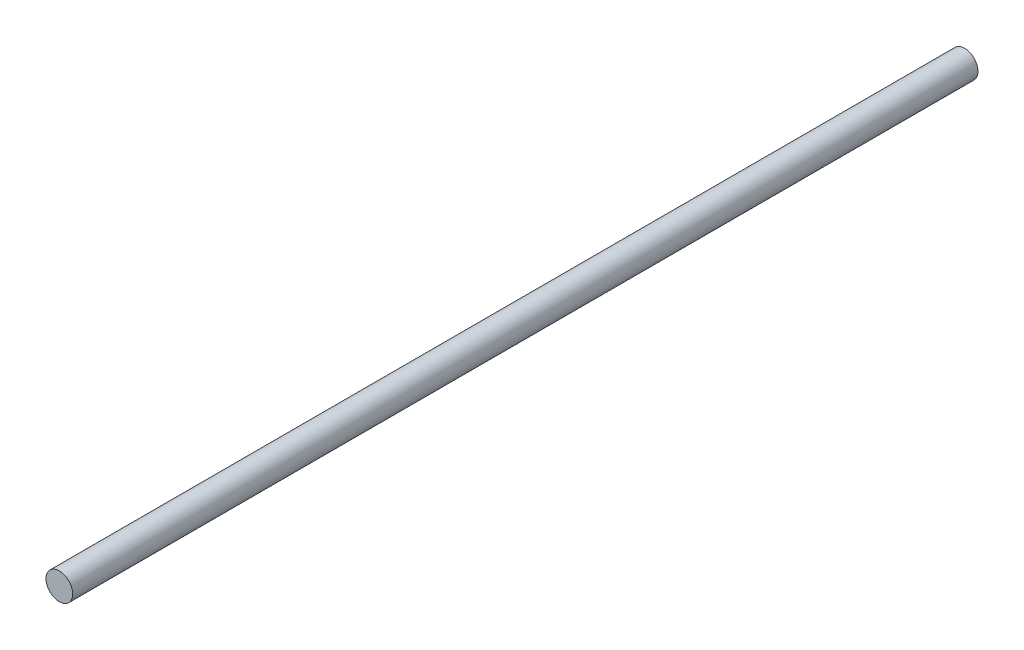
from build123d import *

# Parameters (mm, degrees)
SKETCH_1_R      = 3.175
EXTRUDE_1_DEPTH = 215


with BuildPart() as part:
    # Sketch 1 → Extrude 1 (new body)
    with BuildSketch(Plane.XY):
        Circle(SKETCH_1_R)
    extrude(amount=EXTRUDE_1_DEPTH)


solid = part.part
